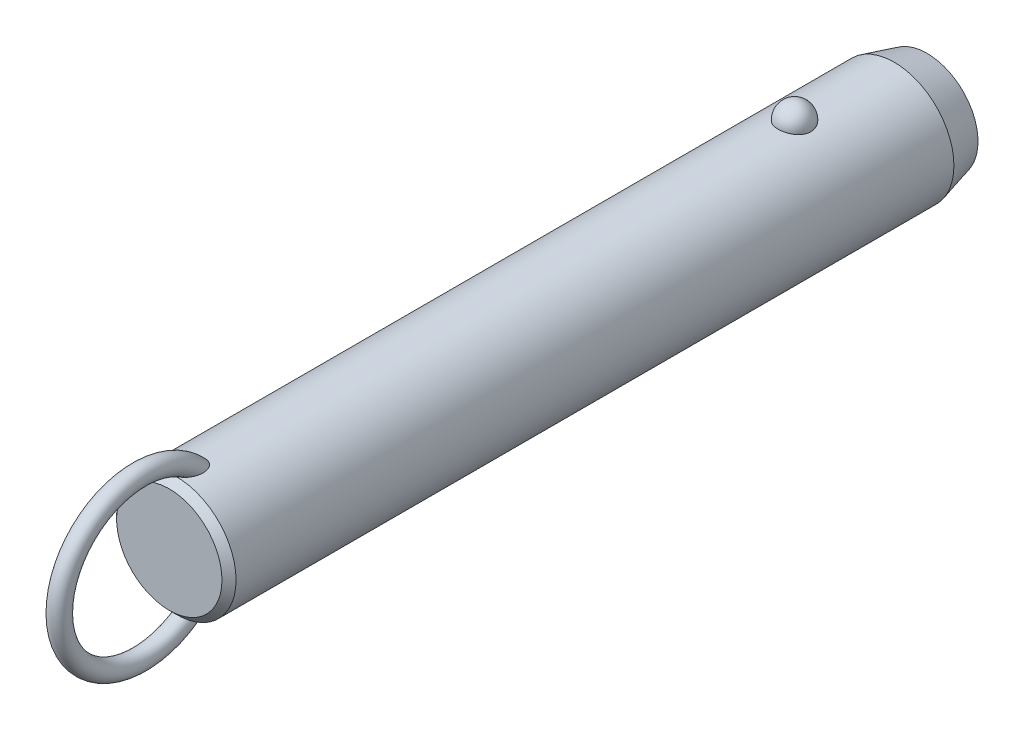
ISO-10303-21;
HEADER;
FILE_DESCRIPTION(('STEP AP214'),'2;1');
FILE_NAME('part.step','',(''),(''),'','','');
FILE_SCHEMA(('AUTOMOTIVE_DESIGN { 1 0 10303 214 1 1 1 1 }'));
ENDSEC;
DATA;
#1=APPLICATION_CONTEXT('core data for automotive mechanical design processes');
#2=APPLICATION_PROTOCOL_DEFINITION('international standard','automotive_design',2000,#1);
#3=PRODUCT_CONTEXT('',#1,'mechanical');
#4=PRODUCT('Part','Part','',(#3));
#5=PRODUCT_RELATED_PRODUCT_CATEGORY('part','',(#4));
#6=PRODUCT_DEFINITION_FORMATION('','',#4);
#7=PRODUCT_DEFINITION_CONTEXT('part definition',#1,'design');
#8=PRODUCT_DEFINITION('design','',#6,#7);
#9=PRODUCT_DEFINITION_SHAPE('','',#8);
#10=(LENGTH_UNIT() NAMED_UNIT(*) SI_UNIT(.MILLI.,.METRE.));
#11=(NAMED_UNIT(*) PLANE_ANGLE_UNIT() SI_UNIT($,.RADIAN.));
#12=(NAMED_UNIT(*) SI_UNIT($,.STERADIAN.) SOLID_ANGLE_UNIT());
#13=UNCERTAINTY_MEASURE_WITH_UNIT(LENGTH_MEASURE(1.E-05),#10,'distance_accuracy_value','');
#14=(GEOMETRIC_REPRESENTATION_CONTEXT(3) GLOBAL_UNCERTAINTY_ASSIGNED_CONTEXT((#13)) GLOBAL_UNIT_ASSIGNED_CONTEXT((#10,
#11,#12)) REPRESENTATION_CONTEXT('',''));
#15=CARTESIAN_POINT('',(0.,0.,0.));
#16=DIRECTION('',(0.,0.,1.));
#17=DIRECTION('',(1.,0.,0.));
#18=AXIS2_PLACEMENT_3D('',#15,#16,#17);
#19=CARTESIAN_POINT('',(0.,0.,116.8));
#20=DIRECTION('',(0.,0.,-1.));
#21=DIRECTION('',(-1.,0.,0.));
#22=AXIS2_PLACEMENT_3D('',#19,#20,#21);
#23=CYLINDRICAL_SURFACE('',#22,12.7);
#24=CARTESIAN_POINT('',(3.46661256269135,12.2177165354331,-3.5));
#25=CARTESIAN_POINT('',(3.4666090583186,12.2177194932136,-3.30432790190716));
#26=CARTESIAN_POINT('',(3.45063567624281,12.2222841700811,-3.10861112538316));
#27=CARTESIAN_POINT('',(3.38712451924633,12.2400345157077,-2.72271899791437));
#28=CARTESIAN_POINT('',(3.33957415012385,12.2532236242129,-2.53254588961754));
#29=CARTESIAN_POINT('',(3.2141234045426,12.286724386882,-2.16324948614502));
#30=CARTESIAN_POINT('',(3.13623639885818,12.3070329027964,-1.98412136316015));
#31=CARTESIAN_POINT('',(2.95205930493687,12.3525018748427,-1.64180592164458));
#32=CARTESIAN_POINT('',(2.84577003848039,12.3776621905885,-1.47861814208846));
#33=CARTESIAN_POINT('',(2.60688050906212,12.4301712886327,-1.17190583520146));
#34=CARTESIAN_POINT('',(2.47415697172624,12.4575299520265,-1.02847897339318));
#35=CARTESIAN_POINT('',(2.18615174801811,12.5112810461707,-0.766177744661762));
#36=CARTESIAN_POINT('',(2.03087002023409,12.5376734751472,-0.64730342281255));
#37=CARTESIAN_POINT('',(1.70237334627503,12.5864761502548,-0.437732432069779));
#38=CARTESIAN_POINT('',(1.52920948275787,12.6088972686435,-0.346958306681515));
#39=CARTESIAN_POINT('',(1.16944170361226,12.6473352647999,-0.195750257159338));
#40=CARTESIAN_POINT('',(0.982839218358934,12.663352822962,-0.135313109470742));
#41=CARTESIAN_POINT('',(0.604961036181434,12.6869706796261,-0.0473241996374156));
#42=CARTESIAN_POINT('',(0.41382314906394,12.6947125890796,-0.0192185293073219));
#43=CARTESIAN_POINT('',(0.0293827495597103,12.7014203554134,0.0051725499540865));
#44=CARTESIAN_POINT('',(-0.163919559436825,12.7003870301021,0.00146092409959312));
#45=CARTESIAN_POINT('',(-0.544374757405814,12.689735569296,-0.0373939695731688));
#46=CARTESIAN_POINT('',(-0.731575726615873,12.6802364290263,-0.0721015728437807));
#47=CARTESIAN_POINT('',(-1.09733277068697,12.6538333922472,-0.171364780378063));
#48=CARTESIAN_POINT('',(-1.27588869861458,12.6369293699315,-0.235920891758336));
#49=CARTESIAN_POINT('',(-1.6204698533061,12.5973946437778,-0.393548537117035));
#50=CARTESIAN_POINT('',(-1.78641865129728,12.5747321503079,-0.486778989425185));
#51=CARTESIAN_POINT('',(-2.10030671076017,12.5261316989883,-0.699110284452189));
#52=CARTESIAN_POINT('',(-2.24824419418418,12.5001934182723,-0.818213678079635));
#53=CARTESIAN_POINT('',(-2.52491489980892,12.4472906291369,-1.08157124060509));
#54=CARTESIAN_POINT('',(-2.65324222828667,12.4203160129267,-1.22624992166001));
#55=CARTESIAN_POINT('',(-2.88410007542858,12.3687509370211,-1.53528325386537));
#56=CARTESIAN_POINT('',(-2.98662883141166,12.3441606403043,-1.69963924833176));
#57=CARTESIAN_POINT('',(-3.16432417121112,12.2998199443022,-2.04548497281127));
#58=CARTESIAN_POINT('',(-3.23917525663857,12.2801261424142,-2.22714424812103));
#59=CARTESIAN_POINT('',(-3.35800573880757,12.248167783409,-2.6009138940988));
#60=CARTESIAN_POINT('',(-3.4019860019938,12.2359030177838,-2.79302397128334));
#61=CARTESIAN_POINT('',(-3.45784812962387,12.2202347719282,-3.18140279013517));
#62=CARTESIAN_POINT('',(-3.46986123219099,12.2167950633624,-3.37765118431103));
#63=CARTESIAN_POINT('',(-3.46186273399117,12.2190638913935,-3.76943689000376));
#64=CARTESIAN_POINT('',(-3.44185196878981,12.2247721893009,-3.96497421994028));
#65=CARTESIAN_POINT('',(-3.37048652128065,12.2446381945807,-4.34881728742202));
#66=CARTESIAN_POINT('',(-3.31928253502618,12.2587552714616,-4.53715319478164));
#67=CARTESIAN_POINT('',(-3.18693461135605,12.2938237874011,-4.90231727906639));
#68=CARTESIAN_POINT('',(-3.1057895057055,12.3147754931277,-5.07914500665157));
#69=CARTESIAN_POINT('',(-2.91506431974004,12.3613125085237,-5.41732059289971));
#70=CARTESIAN_POINT('',(-2.80533587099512,12.3869217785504,-5.57858147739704));
#71=CARTESIAN_POINT('',(-2.560414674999,12.4398525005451,-5.88013283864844));
#72=CARTESIAN_POINT('',(-2.42522099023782,12.4671740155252,-6.02042254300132));
#73=CARTESIAN_POINT('',(-2.1323357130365,12.5205965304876,-6.27662798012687));
#74=CARTESIAN_POINT('',(-1.97456596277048,12.5466928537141,-6.3924554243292));
#75=CARTESIAN_POINT('',(-1.64115839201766,12.5946384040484,-6.59583547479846));
#76=CARTESIAN_POINT('',(-1.46552179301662,12.6164879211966,-6.68339001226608));
#77=CARTESIAN_POINT('',(-1.10356050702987,12.6532533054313,-6.82682153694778));
#78=CARTESIAN_POINT('',(-0.9173913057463,12.6682500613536,-6.8830698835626));
#79=CARTESIAN_POINT('',(-0.537836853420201,12.6900288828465,-6.96386887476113));
#80=CARTESIAN_POINT('',(-0.344452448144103,12.6968119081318,-6.9884232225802));
#81=CARTESIAN_POINT('',(0.0402577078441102,12.7013667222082,-7.00496469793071));
#82=CARTESIAN_POINT('',(0.231556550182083,12.6993008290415,-6.99753844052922));
#83=CARTESIAN_POINT('',(0.610105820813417,12.6867505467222,-6.9516636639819));
#84=CARTESIAN_POINT('',(0.797356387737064,12.6762664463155,-6.913216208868));
#85=CARTESIAN_POINT('',(1.16186657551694,12.6480587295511,-6.80658431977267));
#86=CARTESIAN_POINT('',(1.33915951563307,12.6303611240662,-6.73850666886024));
#87=CARTESIAN_POINT('',(1.67968518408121,12.5896027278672,-6.5745087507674));
#88=CARTESIAN_POINT('',(1.84291705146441,12.5665416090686,-6.47858678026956));
#89=CARTESIAN_POINT('',(2.15340192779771,12.5171072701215,-6.25982455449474));
#90=CARTESIAN_POINT('',(2.30037831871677,12.4906895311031,-6.13660186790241));
#91=CARTESIAN_POINT('',(2.5717412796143,12.4376567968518,-5.86739587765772));
#92=CARTESIAN_POINT('',(2.69612388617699,12.4110417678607,-5.72140858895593));
#93=CARTESIAN_POINT('',(2.92107785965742,12.360051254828,-5.40794137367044));
#94=CARTESIAN_POINT('',(3.02121329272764,12.3357209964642,-5.24014110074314));
#95=CARTESIAN_POINT('',(3.19236291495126,12.2925446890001,-4.88969865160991));
#96=CARTESIAN_POINT('',(3.26338839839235,12.2736965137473,-4.70706226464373));
#97=CARTESIAN_POINT('',(3.36788038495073,12.245404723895,-4.35469510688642));
#98=CARTESIAN_POINT('',(3.40484026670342,12.2351018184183,-4.18605935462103));
#99=CARTESIAN_POINT('',(3.45420764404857,12.2212564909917,-3.84496058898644));
#100=CARTESIAN_POINT('',(3.46661565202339,12.2177139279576,-3.67249765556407));
#101=CARTESIAN_POINT('',(3.46661256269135,12.2177165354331,-3.5));
#102=B_SPLINE_CURVE_WITH_KNOTS('',3,(#24,#25,#26,#27,#28,#29,#30,#31,#32,#33,#34,#35,#36,#37,
#38,#39,#40,#41,#42,#43,#44,#45,#46,#47,#48,#49,#50,#51,#52,#53,#54,#55,#56,#57,#58,#59,#60,#61,
#62,#63,#64,#65,#66,#67,#68,#69,#70,#71,#72,#73,#74,#75,#76,#77,#78,#79,#80,#81,#82,#83,#84,#85,
#86,#87,#88,#89,#90,#91,#92,#93,#94,#95,#96,#97,#98,#99,#100,#101),.UNSPECIFIED.,.T.,.F.,(4,2,2,
2,2,2,2,2,2,2,2,2,2,2,2,2,2,2,2,2,2,2,2,2,2,2,2,2,2,2,2,2,2,2,2,2,2,2,4),(0.,0.586396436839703,
1.17302689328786,1.7593990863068,2.34575431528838,2.93491084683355,3.52406845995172,
4.11158733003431,4.69904375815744,5.2762784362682,5.85345931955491,6.42265312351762,
6.99185659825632,7.56427334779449,8.136746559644,8.71981013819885,9.3029135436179,
9.89247258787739,10.4820150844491,11.0691335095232,11.6562366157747,12.2405256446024,
12.8248374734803,13.412244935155,13.9996740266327,14.5891883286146,15.1786623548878,
15.7609861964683,16.3432419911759,16.9148635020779,17.4864654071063,18.0560241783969,
18.6256177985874,19.2037609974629,19.7820055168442,20.3699810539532,20.957728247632,
21.4746855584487,21.9916320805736),.UNSPECIFIED.);
#103=CARTESIAN_POINT('',(3.46661256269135,12.2177165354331,-3.5));
#104=VERTEX_POINT('',#103);
#105=EDGE_CURVE('E41',#104,#104,#102,.T.);
#106=ORIENTED_EDGE('',*,*,#105,.T.);
#107=EDGE_LOOP('',(#106));
#108=FACE_BOUND('',#107,.T.);
#109=CARTESIAN_POINT('',(0.,0.,128.));
#110=DIRECTION('',(0.,0.,1.));
#111=DIRECTION('',(1.,0.,0.));
#112=AXIS2_PLACEMENT_3D('',#109,#110,#111);
#113=CIRCLE('',#112,12.7);
#114=CARTESIAN_POINT('',(12.7,0.,128.));
#115=VERTEX_POINT('',#114);
#116=EDGE_CURVE('E10',#115,#115,#113,.F.);
#117=ORIENTED_EDGE('',*,*,#116,.T.);
#118=EDGE_LOOP('',(#117));
#119=FACE_BOUND('',#118,.T.);
#120=CARTESIAN_POINT('',(-0.548122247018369,-12.6881662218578,121.743218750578));
#121=CARTESIAN_POINT('',(-0.648865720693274,-12.6838128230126,121.777926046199));
#122=CARTESIAN_POINT('',(-0.746398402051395,-12.6783867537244,121.822042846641));
#123=CARTESIAN_POINT('',(-0.932125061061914,-12.666091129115,121.926764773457));
#124=CARTESIAN_POINT('',(-1.02030388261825,-12.6592192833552,121.987396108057));
#125=CARTESIAN_POINT('',(-1.18487740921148,-12.6448747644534,122.121847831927));
#126=CARTESIAN_POINT('',(-1.26134296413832,-12.637406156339,122.195582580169));
#127=CARTESIAN_POINT('',(-1.40231200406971,-12.6225412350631,122.353604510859));
#128=CARTESIAN_POINT('',(-1.46681470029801,-12.6151449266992,122.43789238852));
#129=CARTESIAN_POINT('',(-1.60714786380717,-12.5981718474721,122.649657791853));
#130=CARTESIAN_POINT('',(-1.67725126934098,-12.588900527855,122.780962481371));
#131=CARTESIAN_POINT('',(-1.79536591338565,-12.5725964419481,123.053247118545));
#132=CARTESIAN_POINT('',(-1.84333535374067,-12.5655679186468,123.194244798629));
#133=CARTESIAN_POINT('',(-1.93422576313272,-12.5519624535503,123.537645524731));
#134=CARTESIAN_POINT('',(-1.96788773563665,-12.5466298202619,123.742557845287));
#135=CARTESIAN_POINT('',(-1.9941399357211,-12.542463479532,124.051760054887));
#136=CARTESIAN_POINT('',(-1.99883864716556,-12.5417153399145,124.155298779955));
#137=CARTESIAN_POINT('',(-2.00078003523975,-12.5414074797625,124.36245124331));
#138=CARTESIAN_POINT('',(-1.99802449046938,-12.5418474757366,124.466064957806));
#139=CARTESIAN_POINT('',(-1.98336733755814,-12.5441750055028,124.710320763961));
#140=CARTESIAN_POINT('',(-1.96851430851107,-12.5465291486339,124.850780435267));
#141=CARTESIAN_POINT('',(-1.92707089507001,-12.5529612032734,125.129960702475));
#142=CARTESIAN_POINT('',(-1.90047458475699,-12.5570399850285,125.268680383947));
#143=CARTESIAN_POINT('',(-1.83619120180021,-12.5666008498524,125.54341135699));
#144=CARTESIAN_POINT('',(-1.79850828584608,-12.57208240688,125.679423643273));
#145=CARTESIAN_POINT('',(-1.71223796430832,-12.5841228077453,125.947842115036));
#146=CARTESIAN_POINT('',(-1.66365679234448,-12.5906810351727,126.080250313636));
#147=CARTESIAN_POINT('',(-1.5780450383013,-12.6016176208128,126.28548877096));
#148=CARTESIAN_POINT('',(-1.54477252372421,-12.6057501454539,126.359914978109));
#149=CARTESIAN_POINT('',(-1.47424480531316,-12.6141930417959,126.506839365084));
#150=CARTESIAN_POINT('',(-1.436990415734,-12.6185033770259,126.579337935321));
#151=CARTESIAN_POINT('',(-1.35825795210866,-12.6272207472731,126.721892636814));
#152=CARTESIAN_POINT('',(-1.31678520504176,-12.6316276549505,126.791951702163));
#153=CARTESIAN_POINT('',(-1.22917793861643,-12.6404532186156,126.929070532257));
#154=CARTESIAN_POINT('',(-1.18304514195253,-12.6448718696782,126.996131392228));
#155=CARTESIAN_POINT('',(-1.0724641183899,-12.6547893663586,127.143874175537));
#156=CARTESIAN_POINT('',(-1.00642239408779,-12.6602600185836,127.223384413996));
#157=CARTESIAN_POINT('',(-0.864441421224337,-12.6707460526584,127.373169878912));
#158=CARTESIAN_POINT('',(-0.788516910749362,-12.6757620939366,127.443458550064));
#159=CARTESIAN_POINT('',(-0.652215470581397,-12.6833591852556,127.548680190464));
#160=CARTESIAN_POINT('',(-0.594982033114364,-12.6861973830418,127.587624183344));
#161=CARTESIAN_POINT('',(-0.475269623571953,-12.6912445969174,127.656489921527));
#162=CARTESIAN_POINT('',(-0.412800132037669,-12.6934547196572,127.686427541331));
#163=CARTESIAN_POINT('',(-0.295749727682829,-12.6966636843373,127.729756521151));
#164=CARTESIAN_POINT('',(-0.241949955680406,-12.6978134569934,127.745218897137));
#165=CARTESIAN_POINT('',(-0.13250810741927,-12.6994261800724,127.766884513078));
#166=CARTESIAN_POINT('',(-0.0768679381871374,-12.6998898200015,127.773097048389));
#167=CARTESIAN_POINT('',(0.0347696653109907,-12.7000752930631,127.775583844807));
#168=CARTESIAN_POINT('',(0.0907676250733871,-12.6997954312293,127.771835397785));
#169=CARTESIAN_POINT('',(0.201283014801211,-12.6985255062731,127.754788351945));
#170=CARTESIAN_POINT('',(0.255799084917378,-12.6975348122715,127.741481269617));
#171=CARTESIAN_POINT('',(0.376042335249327,-12.6946091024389,127.70203792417));
#172=CARTESIAN_POINT('',(0.440950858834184,-12.6924943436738,127.673449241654));
#173=CARTESIAN_POINT('',(0.56535027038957,-12.6875639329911,127.606323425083));
#174=CARTESIAN_POINT('',(0.624828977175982,-12.6847467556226,127.567764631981));
#175=CARTESIAN_POINT('',(0.774116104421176,-12.6767252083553,127.456949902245));
#176=CARTESIAN_POINT('',(0.859449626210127,-12.6711344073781,127.378760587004));
#177=CARTESIAN_POINT('',(1.01789440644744,-12.6593922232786,127.210943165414));
#178=CARTESIAN_POINT('',(1.09096902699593,-12.653239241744,127.121282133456));
#179=CARTESIAN_POINT('',(1.22268793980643,-12.6411674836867,126.940265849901));
#180=CARTESIAN_POINT('',(1.28193986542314,-12.6352572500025,126.849345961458));
#181=CARTESIAN_POINT('',(1.39259777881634,-12.6235401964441,126.662792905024));
#182=CARTESIAN_POINT('',(1.44399707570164,-12.6177334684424,126.567155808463));
#183=CARTESIAN_POINT('',(1.53972870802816,-12.6064093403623,126.372273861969));
#184=CARTESIAN_POINT('',(1.58405262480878,-12.6008922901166,126.273024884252));
#185=CARTESIAN_POINT('',(1.66600705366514,-12.5903187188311,126.071772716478));
#186=CARTESIAN_POINT('',(1.70363651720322,-12.5852622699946,125.969769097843));
#187=CARTESIAN_POINT('',(1.77545379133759,-12.5753406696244,125.754358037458));
#188=CARTESIAN_POINT('',(1.80903453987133,-12.5705328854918,125.640745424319));
#189=CARTESIAN_POINT('',(1.86844163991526,-12.5618400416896,125.411457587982));
#190=CARTESIAN_POINT('',(1.89426665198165,-12.5579551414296,125.295782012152));
#191=CARTESIAN_POINT('',(1.93785464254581,-12.5513030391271,125.063007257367));
#192=CARTESIAN_POINT('',(1.95562640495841,-12.5485346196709,124.945909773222));
#193=CARTESIAN_POINT('',(1.98264463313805,-12.5442934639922,124.710747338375));
#194=CARTESIAN_POINT('',(1.99189298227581,-12.5428204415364,124.59268260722));
#195=CARTESIAN_POINT('',(2.00416068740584,-12.540871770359,124.280622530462));
#196=CARTESIAN_POINT('',(1.99944433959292,-12.541631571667,124.086229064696));
#197=CARTESIAN_POINT('',(1.96113755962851,-12.5476846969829,123.700309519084));
#198=CARTESIAN_POINT('',(1.92758341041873,-12.5529723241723,123.508780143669));
#199=CARTESIAN_POINT('',(1.83934342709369,-12.5661532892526,123.182272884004));
#200=CARTESIAN_POINT('',(1.79215440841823,-12.5730485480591,123.04524997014));
#201=CARTESIAN_POINT('',(1.67676242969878,-12.588958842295,122.780445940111));
#202=CARTESIAN_POINT('',(1.60859050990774,-12.597970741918,122.652651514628));
#203=CARTESIAN_POINT('',(1.46583832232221,-12.6152829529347,122.435800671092));
#204=CARTESIAN_POINT('',(1.39525727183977,-12.6233659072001,122.344105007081));
#205=CARTESIAN_POINT('',(1.23992594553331,-12.6395676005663,122.173485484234));
#206=CARTESIAN_POINT('',(1.15517932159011,-12.6476863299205,122.094558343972));
#207=CARTESIAN_POINT('',(0.971995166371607,-12.6630846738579,121.952643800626));
#208=CARTESIAN_POINT('',(0.873456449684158,-12.6703572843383,121.889784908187));
#209=CARTESIAN_POINT('',(0.665847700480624,-12.6829569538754,121.784487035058));
#210=CARTESIAN_POINT('',(0.5567845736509,-12.688285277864,121.742034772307));
#211=CARTESIAN_POINT('',(0.347338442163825,-12.6956226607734,121.684443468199));
#212=CARTESIAN_POINT('',(0.247759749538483,-12.6979816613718,121.666399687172));
#213=CARTESIAN_POINT('',(0.0470218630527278,-12.7003077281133,121.648600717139));
#214=CARTESIAN_POINT('',(-0.0541350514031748,-12.7002779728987,121.648821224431));
#215=CARTESIAN_POINT('',(-0.221414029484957,-12.6982482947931,121.664363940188));
#216=CARTESIAN_POINT('',(-0.288055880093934,-12.6969033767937,121.674666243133));
#217=CARTESIAN_POINT('',(-0.419599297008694,-12.6932369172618,121.70313489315));
#218=CARTESIAN_POINT('',(-0.484501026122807,-12.6909154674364,121.721300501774));
#219=CARTESIAN_POINT('',(-0.548122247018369,-12.6881662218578,121.743218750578));
#220=B_SPLINE_CURVE_WITH_KNOTS('',3,(#120,#121,#122,#123,#124,#125,#126,#127,#128,#129,#130,
#131,#132,#133,#134,#135,#136,#137,#138,#139,#140,#141,#142,#143,#144,#145,#146,#147,#148,#149,
#150,#151,#152,#153,#154,#155,#156,#157,#158,#159,#160,#161,#162,#163,#164,#165,#166,#167,#168,
#169,#170,#171,#172,#173,#174,#175,#176,#177,#178,#179,#180,#181,#182,#183,#184,#185,#186,#187,
#188,#189,#190,#191,#192,#193,#194,#195,#196,#197,#198,#199,#200,#201,#202,#203,#204,#205,#206,
#207,#208,#209,#210,#211,#212,#213,#214,#215,#216,#217,#218,#219),.UNSPECIFIED.,.T.,.F.,(4,2,2,
2,2,2,2,2,2,2,2,2,2,2,2,2,2,2,2,2,2,2,2,2,2,2,2,2,2,2,2,2,2,2,2,2,2,2,2,2,2,2,2,2,2,2,2,2,2,4),
(0.,0.319642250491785,0.639794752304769,0.957927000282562,1.27608021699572,1.72100165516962,
2.16675988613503,2.78630021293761,3.0970578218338,3.40774128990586,3.83096358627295,
4.2543996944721,4.67767724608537,5.10071330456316,5.34550297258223,5.59024267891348,
5.83467707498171,6.07902143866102,6.38891080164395,6.69834321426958,6.90560910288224,
7.11250749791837,7.27977315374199,7.44687060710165,7.61434932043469,7.78197685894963,
7.99365544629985,8.20579780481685,8.55147335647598,8.89816429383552,9.22375138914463,
9.54961437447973,9.87586224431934,10.202161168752,10.5575872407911,10.9130746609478,
11.2681734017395,11.6231936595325,12.2046601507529,12.7853961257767,13.219164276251,
13.6522938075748,13.9989174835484,14.3454519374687,14.6946768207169,15.0436740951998,
15.3457513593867,15.6474266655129,15.8493051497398,16.0511646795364),.UNSPECIFIED.);
#221=CARTESIAN_POINT('',(-0.548122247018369,-12.6881662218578,121.743218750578));
#222=VERTEX_POINT('',#221);
#223=EDGE_CURVE('E59',#222,#222,#220,.T.);
#224=ORIENTED_EDGE('',*,*,#223,.T.);
#225=EDGE_LOOP('',(#224));
#226=FACE_BOUND('',#225,.T.);
#227=CARTESIAN_POINT('',(-0.548122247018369,12.6881662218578,121.743218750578));
#228=CARTESIAN_POINT('',(-0.459436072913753,12.6919968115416,121.712673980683));
#229=CARTESIAN_POINT('',(-0.368189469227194,12.6949996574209,121.689391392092));
#230=CARTESIAN_POINT('',(-0.183024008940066,12.6990186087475,121.658406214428));
#231=CARTESIAN_POINT('',(-0.0891049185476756,12.7000345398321,121.650704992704));
#232=CARTESIAN_POINT('',(0.0987147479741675,12.6999636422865,121.651245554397));
#233=CARTESIAN_POINT('',(0.192615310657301,12.6988761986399,121.659492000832));
#234=CARTESIAN_POINT('',(0.377658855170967,12.6947211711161,121.691551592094));
#235=CARTESIAN_POINT('',(0.468801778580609,12.6916535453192,121.715365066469));
#236=CARTESIAN_POINT('',(0.645809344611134,12.6838788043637,121.77745651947));
#237=CARTESIAN_POINT('',(0.731679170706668,12.6791733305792,121.815720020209));
#238=CARTESIAN_POINT('',(0.896315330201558,12.6686004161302,121.905120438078));
#239=CARTESIAN_POINT('',(0.975080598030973,12.6627328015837,121.956259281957));
#240=CARTESIAN_POINT('',(1.12963655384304,12.6499161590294,122.07367820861));
#241=CARTESIAN_POINT('',(1.20478673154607,12.6429194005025,122.140792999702));
#242=CARTESIAN_POINT('',(1.34448241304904,12.6288282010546,122.28522507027));
#243=CARTESIAN_POINT('',(1.40902173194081,12.621733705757,122.362548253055));
#244=CARTESIAN_POINT('',(1.55208211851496,12.6050877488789,122.559247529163));
#245=CARTESIAN_POINT('',(1.62510490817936,12.5957546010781,122.682654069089));
#246=CARTESIAN_POINT('',(1.75019044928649,12.5789823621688,122.939769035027));
#247=CARTESIAN_POINT('',(1.80221377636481,12.5715468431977,123.073496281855));
#248=CARTESIAN_POINT('',(1.90309965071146,12.5567434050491,123.398351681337));
#249=CARTESIAN_POINT('',(1.94342317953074,12.5504515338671,123.592161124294));
#250=CARTESIAN_POINT('',(1.99332997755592,12.5426147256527,123.98378810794));
#251=CARTESIAN_POINT('',(2.00285305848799,12.5410790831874,124.181612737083));
#252=CARTESIAN_POINT('',(1.99678999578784,12.5420407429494,124.516642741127));
#253=CARTESIAN_POINT('',(1.98794117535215,12.5434564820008,124.654042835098));
#254=CARTESIAN_POINT('',(1.95865119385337,12.5480641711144,124.927639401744));
#255=CARTESIAN_POINT('',(1.93820436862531,12.5512569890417,125.063835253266));
#256=CARTESIAN_POINT('',(1.88647896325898,12.5591352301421,125.334249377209));
#257=CARTESIAN_POINT('',(1.85518800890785,12.5638223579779,125.46846520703));
#258=CARTESIAN_POINT('',(1.78217886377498,12.5743868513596,125.733936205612));
#259=CARTESIAN_POINT('',(1.74046509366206,12.5802637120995,125.865192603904));
#260=CARTESIAN_POINT('',(1.66024095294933,12.5910571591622,126.086085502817));
#261=CARTESIAN_POINT('',(1.62434772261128,12.5957535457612,126.176690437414));
#262=CARTESIAN_POINT('',(1.54709009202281,12.6054762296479,126.355512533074));
#263=CARTESIAN_POINT('',(1.50572681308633,12.6105024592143,126.443730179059));
#264=CARTESIAN_POINT('',(1.41728020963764,12.620748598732,126.616932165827));
#265=CARTESIAN_POINT('',(1.37021377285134,12.625967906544,126.701925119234));
#266=CARTESIAN_POINT('',(1.26969620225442,12.6364721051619,126.868007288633));
#267=CARTESIAN_POINT('',(1.21624929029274,12.6417569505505,126.949099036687));
#268=CARTESIAN_POINT('',(1.10304413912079,12.6521331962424,127.104702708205));
#269=CARTESIAN_POINT('',(1.04340936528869,12.657226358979,127.179303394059));
#270=CARTESIAN_POINT('',(0.915919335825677,12.6670906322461,127.321324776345));
#271=CARTESIAN_POINT('',(0.848064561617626,12.6718617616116,127.388745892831));
#272=CARTESIAN_POINT('',(0.717035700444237,12.67987711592,127.500624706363));
#273=CARTESIAN_POINT('',(0.655526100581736,12.6832377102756,127.546997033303));
#274=CARTESIAN_POINT('',(0.525985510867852,12.6892676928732,127.629619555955));
#275=CARTESIAN_POINT('',(0.457969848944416,12.6919386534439,127.665892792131));
#276=CARTESIAN_POINT('',(0.334859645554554,12.695691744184,127.716657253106));
#277=CARTESIAN_POINT('',(0.28111658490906,12.6970073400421,127.734373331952));
#278=CARTESIAN_POINT('',(0.171425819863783,12.6989609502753,127.760642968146));
#279=CARTESIAN_POINT('',(0.115480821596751,12.699599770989,127.769207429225));
#280=CARTESIAN_POINT('',(0.0027261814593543,12.7001251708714,127.776253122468));
#281=CARTESIAN_POINT('',(-0.054085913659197,12.7000089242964,127.774696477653));
#282=CARTESIAN_POINT('',(-0.166544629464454,12.6990328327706,127.761600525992));
#283=CARTESIAN_POINT('',(-0.222190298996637,12.6981724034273,127.750053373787));
#284=CARTESIAN_POINT('',(-0.342018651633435,12.695562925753,127.714912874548));
#285=CARTESIAN_POINT('',(-0.405606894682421,12.6936676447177,127.68933225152));
#286=CARTESIAN_POINT('',(-0.5278154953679,12.6891754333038,127.628311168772));
#287=CARTESIAN_POINT('',(-0.586425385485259,12.6865770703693,127.592850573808));
#288=CARTESIAN_POINT('',(-0.731842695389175,12.6792129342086,127.491496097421));
#289=CARTESIAN_POINT('',(-0.814709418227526,12.6740767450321,127.4200395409));
#290=CARTESIAN_POINT('',(-0.96910175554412,12.6632083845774,127.26589007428));
#291=CARTESIAN_POINT('',(-1.04059564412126,12.6574746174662,127.183166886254));
#292=CARTESIAN_POINT('',(-1.16981116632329,12.6461638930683,127.015809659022));
#293=CARTESIAN_POINT('',(-1.22811369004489,12.6405994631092,126.931616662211));
#294=CARTESIAN_POINT('',(-1.33743405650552,12.6295007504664,126.758579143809));
#295=CARTESIAN_POINT('',(-1.38844577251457,12.6239664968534,126.669730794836));
#296=CARTESIAN_POINT('',(-1.48400702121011,12.6130898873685,126.488389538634));
#297=CARTESIAN_POINT('',(-1.52854232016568,12.6077479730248,126.395889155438));
#298=CARTESIAN_POINT('',(-1.61150113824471,12.5974127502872,126.208160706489));
#299=CARTESIAN_POINT('',(-1.64992317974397,12.5924195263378,126.112931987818));
#300=CARTESIAN_POINT('',(-1.73468589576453,12.581070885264,125.88289362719));
#301=CARTESIAN_POINT('',(-1.77831261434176,12.5749388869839,125.747066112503));
#302=CARTESIAN_POINT('',(-1.85439734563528,12.5639437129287,125.472212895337));
#303=CARTESIAN_POINT('',(-1.88684994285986,12.5590811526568,125.333185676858));
#304=CARTESIAN_POINT('',(-1.94008483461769,12.550968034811,125.05309235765));
#305=CARTESIAN_POINT('',(-1.96088706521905,12.5477147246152,124.912030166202));
#306=CARTESIAN_POINT('',(-1.99000539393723,12.5431291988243,124.628668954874));
#307=CARTESIAN_POINT('',(-1.99832911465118,12.5417958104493,124.486370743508));
#308=CARTESIAN_POINT('',(-2.00166624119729,12.5412674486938,124.157627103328));
#309=CARTESIAN_POINT('',(-1.99178843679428,12.5428579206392,123.971088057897));
#310=CARTESIAN_POINT('',(-1.9445518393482,12.5502731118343,123.60162404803));
#311=CARTESIAN_POINT('',(-1.90724032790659,12.5560905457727,123.418693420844));
#312=CARTESIAN_POINT('',(-1.81330718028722,12.5699462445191,123.104848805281));
#313=CARTESIAN_POINT('',(-1.76338820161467,12.5771273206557,122.971910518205));
#314=CARTESIAN_POINT('',(-1.64305018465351,12.593414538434,122.715681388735));
#315=CARTESIAN_POINT('',(-1.57265346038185,12.6025185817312,122.592380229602));
#316=CARTESIAN_POINT('',(-1.42634956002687,12.6198178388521,122.383564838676));
#317=CARTESIAN_POINT('',(-1.35423772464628,12.6278405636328,122.295384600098));
#318=CARTESIAN_POINT('',(-1.19645664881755,12.6437632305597,122.132107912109));
#319=CARTESIAN_POINT('',(-1.11080536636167,12.6516633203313,122.056994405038));
#320=CARTESIAN_POINT('',(-0.947219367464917,12.6648319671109,121.937811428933));
#321=CARTESIAN_POINT('',(-0.871624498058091,12.670300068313,121.890541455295));
#322=CARTESIAN_POINT('',(-0.714161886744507,12.6801492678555,121.8077413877));
#323=CARTESIAN_POINT('',(-0.632295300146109,12.684530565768,121.77220913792));
#324=CARTESIAN_POINT('',(-0.548122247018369,12.6881662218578,121.743218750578));
#325=B_SPLINE_CURVE_WITH_KNOTS('',3,(#227,#228,#229,#230,#231,#232,#233,#234,#235,#236,#237,
#238,#239,#240,#241,#242,#243,#244,#245,#246,#247,#248,#249,#250,#251,#252,#253,#254,#255,#256,
#257,#258,#259,#260,#261,#262,#263,#264,#265,#266,#267,#268,#269,#270,#271,#272,#273,#274,#275,
#276,#277,#278,#279,#280,#281,#282,#283,#284,#285,#286,#287,#288,#289,#290,#291,#292,#293,#294,
#295,#296,#297,#298,#299,#300,#301,#302,#303,#304,#305,#306,#307,#308,#309,#310,#311,#312,#313,
#314,#315,#316,#317,#318,#319,#320,#321,#322,#323,#324),.UNSPECIFIED.,.T.,.F.,(4,2,2,2,2,2,2,2,
2,2,2,2,2,2,2,2,2,2,2,2,2,2,2,2,2,2,2,2,2,2,2,2,2,2,2,2,2,2,2,2,2,2,2,2,2,2,2,2,4),(0.,
0.281328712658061,0.562682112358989,0.844117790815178,1.12555942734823,1.40671982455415,
1.68792232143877,1.98972294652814,2.2916988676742,2.72039860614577,3.14989948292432,
3.7408491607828,4.33295293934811,4.7455410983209,5.158330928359,5.57159335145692,
5.98468079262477,6.27722775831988,6.56971484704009,6.86135609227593,7.15280542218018,
7.43927407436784,7.72572595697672,7.95635862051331,8.18646071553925,8.35559393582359,
8.52452541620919,8.69408946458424,8.86378678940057,9.06834348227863,9.27332014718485,
9.60010414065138,9.9277843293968,10.2350252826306,10.5425229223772,10.8506864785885,
11.1589244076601,11.5867893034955,12.0148612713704,12.4421984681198,12.8692745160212,
13.4279365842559,13.9856380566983,14.4107062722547,14.8353130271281,15.1765567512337,
15.5173516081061,15.7844129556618,16.051425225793),.UNSPECIFIED.);
#326=CARTESIAN_POINT('',(-0.548122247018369,12.6881662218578,121.743218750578));
#327=VERTEX_POINT('',#326);
#328=EDGE_CURVE('E66',#327,#327,#325,.T.);
#329=ORIENTED_EDGE('',*,*,#328,.T.);
#330=EDGE_LOOP('',(#329));
#331=FACE_BOUND('',#330,.T.);
#332=CARTESIAN_POINT('',(0.,0.,-24.7));
#333=DIRECTION('',(0.,0.,-1.));
#334=DIRECTION('',(-1.,0.,0.));
#335=AXIS2_PLACEMENT_3D('',#332,#333,#334);
#336=CIRCLE('',#335,12.7);
#337=CARTESIAN_POINT('',(12.7,0.,-24.7));
#338=VERTEX_POINT('',#337);
#339=EDGE_CURVE('E56',#338,#338,#336,.F.);
#340=ORIENTED_EDGE('',*,*,#339,.T.);
#341=EDGE_LOOP('',(#340));
#342=FACE_BOUND('',#341,.T.);
#343=ADVANCED_FACE('F37',(#108,#119,#226,#331,#342),#23,.T.);
#344=CARTESIAN_POINT('',(0.,0.,-31.7));
#345=DIRECTION('',(0.,0.,-1.));
#346=DIRECTION('',(-1.,0.,0.));
#347=AXIS2_PLACEMENT_3D('',#344,#345,#346);
#348=PLANE('',#347);
#349=CARTESIAN_POINT('',(0.,0.,-31.7));
#350=DIRECTION('',(0.,0.,-1.));
#351=DIRECTION('',(-1.,0.,0.));
#352=AXIS2_PLACEMENT_3D('',#349,#350,#351);
#353=CIRCLE('',#352,10.8243556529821);
#354=CARTESIAN_POINT('',(10.8243556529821,0.,-31.7));
#355=VERTEX_POINT('',#354);
#356=EDGE_CURVE('E65',#355,#355,#353,.T.);
#357=ORIENTED_EDGE('',*,*,#356,.T.);
#358=EDGE_LOOP('',(#357));
#359=FACE_BOUND('',#358,.T.);
#360=ADVANCED_FACE('F84',(#359),#348,.T.);
#361=CARTESIAN_POINT('',(0.,0.,-31.7));
#362=DIRECTION('',(0.,0.,1.));
#363=DIRECTION('',(1.,0.,0.));
#364=AXIS2_PLACEMENT_3D('',#361,#362,#363);
#365=CONICAL_SURFACE('',#364,10.8243556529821,0.261799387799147);
#366=CARTESIAN_POINT('',(12.7,0.,-24.7));
#367=CARTESIAN_POINT('',(12.6804620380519,0.,-24.7729166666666));
#368=CARTESIAN_POINT('',(12.6609240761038,0.,-24.8458333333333));
#369=CARTESIAN_POINT('',(12.6218481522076,0.,-24.9916666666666));
#370=CARTESIAN_POINT('',(12.6023101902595,0.,-25.0645833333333));
#371=CARTESIAN_POINT('',(12.5632342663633,0.,-25.2104166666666));
#372=CARTESIAN_POINT('',(12.5436963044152,0.,-25.2833333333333));
#373=CARTESIAN_POINT('',(12.504620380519,0.,-25.4291666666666));
#374=CARTESIAN_POINT('',(12.4850824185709,0.,-25.5020833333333));
#375=CARTESIAN_POINT('',(12.4460064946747,0.,-25.6479166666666));
#376=CARTESIAN_POINT('',(12.4264685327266,0.,-25.7208333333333));
#377=CARTESIAN_POINT('',(12.3873926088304,0.,-25.8666666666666));
#378=CARTESIAN_POINT('',(12.3678546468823,0.,-25.9395833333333));
#379=CARTESIAN_POINT('',(12.328778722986,0.,-26.0854166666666));
#380=CARTESIAN_POINT('',(12.3092407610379,0.,-26.1583333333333));
#381=CARTESIAN_POINT('',(12.2701648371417,0.,-26.3041666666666));
#382=CARTESIAN_POINT('',(12.2506268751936,0.,-26.3770833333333));
#383=CARTESIAN_POINT('',(12.2115509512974,0.,-26.5229166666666));
#384=CARTESIAN_POINT('',(12.1920129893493,0.,-26.5958333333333));
#385=CARTESIAN_POINT('',(12.1529370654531,0.,-26.7416666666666));
#386=CARTESIAN_POINT('',(12.133399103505,0.,-26.8145833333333));
#387=CARTESIAN_POINT('',(12.0943231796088,0.,-26.9604166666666));
#388=CARTESIAN_POINT('',(12.0747852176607,0.,-27.0333333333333));
#389=CARTESIAN_POINT('',(12.0357092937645,0.,-27.1791666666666));
#390=CARTESIAN_POINT('',(12.0161713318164,0.,-27.2520833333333));
#391=CARTESIAN_POINT('',(11.9770954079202,0.,-27.3979166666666));
#392=CARTESIAN_POINT('',(11.9575574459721,0.,-27.4708333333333));
#393=CARTESIAN_POINT('',(11.9184815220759,0.,-27.6166666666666));
#394=CARTESIAN_POINT('',(11.8989435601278,0.,-27.6895833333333));
#395=CARTESIAN_POINT('',(11.8598676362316,0.,-27.8354166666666));
#396=CARTESIAN_POINT('',(11.8403296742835,0.,-27.9083333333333));
#397=CARTESIAN_POINT('',(11.8012537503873,0.,-28.0541666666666));
#398=CARTESIAN_POINT('',(11.7817157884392,0.,-28.1270833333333));
#399=CARTESIAN_POINT('',(11.742639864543,0.,-28.2729166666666));
#400=CARTESIAN_POINT('',(11.7231019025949,0.,-28.3458333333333));
#401=CARTESIAN_POINT('',(11.6840259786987,0.,-28.4916666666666));
#402=CARTESIAN_POINT('',(11.6644880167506,0.,-28.5645833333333));
#403=CARTESIAN_POINT('',(11.6254120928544,0.,-28.7104166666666));
#404=CARTESIAN_POINT('',(11.6058741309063,0.,-28.7833333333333));
#405=CARTESIAN_POINT('',(11.56679820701,0.,-28.9291666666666));
#406=CARTESIAN_POINT('',(11.5472602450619,0.,-29.0020833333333));
#407=CARTESIAN_POINT('',(11.5081843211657,0.,-29.1479166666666));
#408=CARTESIAN_POINT('',(11.4886463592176,0.,-29.2208333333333));
#409=CARTESIAN_POINT('',(11.4495704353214,0.,-29.3666666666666));
#410=CARTESIAN_POINT('',(11.4300324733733,0.,-29.4395833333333));
#411=CARTESIAN_POINT('',(11.3909565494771,0.,-29.5854166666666));
#412=CARTESIAN_POINT('',(11.371418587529,0.,-29.6583333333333));
#413=CARTESIAN_POINT('',(11.3323426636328,0.,-29.8041666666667));
#414=CARTESIAN_POINT('',(11.3128047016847,0.,-29.8770833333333));
#415=CARTESIAN_POINT('',(11.2737287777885,0.,-30.0229166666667));
#416=CARTESIAN_POINT('',(11.2541908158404,0.,-30.0958333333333));
#417=CARTESIAN_POINT('',(11.2151148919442,0.,-30.2416666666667));
#418=CARTESIAN_POINT('',(11.1955769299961,0.,-30.3145833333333));
#419=CARTESIAN_POINT('',(11.1565010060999,0.,-30.4604166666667));
#420=CARTESIAN_POINT('',(11.1369630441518,0.,-30.5333333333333));
#421=CARTESIAN_POINT('',(11.0978871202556,0.,-30.6791666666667));
#422=CARTESIAN_POINT('',(11.0783491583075,0.,-30.7520833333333));
#423=CARTESIAN_POINT('',(11.0392732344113,0.,-30.8979166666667));
#424=CARTESIAN_POINT('',(11.0197352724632,0.,-30.9708333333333));
#425=CARTESIAN_POINT('',(10.980659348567,0.,-31.1166666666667));
#426=CARTESIAN_POINT('',(10.9611213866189,0.,-31.1895833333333));
#427=CARTESIAN_POINT('',(10.9220454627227,0.,-31.3354166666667));
#428=CARTESIAN_POINT('',(10.9025075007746,0.,-31.4083333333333));
#429=CARTESIAN_POINT('',(10.8634315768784,0.,-31.5541666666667));
#430=CARTESIAN_POINT('',(10.8438936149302,0.,-31.6270833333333));
#431=CARTESIAN_POINT('',(10.8243556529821,0.,-31.7));
#432=B_SPLINE_CURVE_WITH_KNOTS('',3,(#366,#367,#368,#369,#370,#371,#372,#373,#374,#375,#376,
#377,#378,#379,#380,#381,#382,#383,#384,#385,#386,#387,#388,#389,#390,#391,#392,#393,#394,#395,
#396,#397,#398,#399,#400,#401,#402,#403,#404,#405,#406,#407,#408,#409,#410,#411,#412,#413,#414,
#415,#416,#417,#418,#419,#420,#421,#422,#423,#424,#425,#426,#427,#428,#429,#430,#431),
.UNSPECIFIED.,.F.,.F.,(4,2,2,2,2,2,2,2,2,2,2,2,2,2,2,2,2,2,2,2,2,2,2,2,2,2,2,2,2,2,2,2,4),(0.,
0.226466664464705,0.452933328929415,0.679399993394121,0.905866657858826,1.13233332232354,
1.35879998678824,1.58526665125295,1.81173331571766,2.03819998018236,2.26466664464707,
2.49113330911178,2.71759997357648,2.94406663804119,3.1705333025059,3.3969999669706,
3.62346663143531,3.84993329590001,4.07639996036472,4.30286662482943,4.52933328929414,
4.75579995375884,4.98226661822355,5.20873328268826,5.43519994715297,5.66166661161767,
5.88813327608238,6.11459994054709,6.34106660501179,6.5675332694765,6.7939999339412,
7.02046659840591,7.24693326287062),.UNSPECIFIED.);
#433=EDGE_CURVE('BSEAM82',#338,#355,#432,.T.);
#434=ORIENTED_EDGE('',*,*,#339,.F.);
#435=ORIENTED_EDGE('',*,*,#356,.F.);
#436=ORIENTED_EDGE('',*,*,#433,.T.);
#437=ORIENTED_EDGE('',*,*,#433,.F.);
#438=EDGE_LOOP('',(#434,#436,#435,#437));
#439=FACE_BOUND('',#438,.T.);
#440=ADVANCED_FACE('F82',(#439),#365,.T.);
#441=CARTESIAN_POINT('',(0.,0.,129.5));
#442=DIRECTION('',(0.,0.,1.));
#443=DIRECTION('',(1.,0.,0.));
#444=AXIS2_PLACEMENT_3D('',#441,#442,#443);
#445=PLANE('',#444);
#446=CARTESIAN_POINT('',(0.,0.,129.5));
#447=DIRECTION('',(0.,0.,1.));
#448=DIRECTION('',(1.,0.,0.));
#449=AXIS2_PLACEMENT_3D('',#446,#447,#448);
#450=CIRCLE('',#449,11.2);
#451=CARTESIAN_POINT('',(11.2,0.,129.5));
#452=VERTEX_POINT('',#451);
#453=EDGE_CURVE('E50',#452,#452,#450,.T.);
#454=ORIENTED_EDGE('',*,*,#453,.T.);
#455=EDGE_LOOP('',(#454));
#456=FACE_BOUND('',#455,.T.);
#457=ADVANCED_FACE('F76',(#456),#445,.T.);
#458=CARTESIAN_POINT('',(0.,0.,135.85));
#459=DIRECTION('',(1.,0.,0.));
#460=DIRECTION('',(0.,0.,-1.));
#461=AXIS2_PLACEMENT_3D('',#458,#459,#460);
#462=TOROIDAL_SURFACE('',#461,17.05,2.);
#463=ORIENTED_EDGE('',*,*,#328,.F.);
#464=EDGE_LOOP('',(#463));
#465=FACE_BOUND('',#464,.T.);
#466=ORIENTED_EDGE('',*,*,#223,.F.);
#467=EDGE_LOOP('',(#466));
#468=FACE_BOUND('',#467,.T.);
#469=ADVANCED_FACE('F72',(#465,#468),#462,.T.);
#470=CARTESIAN_POINT('',(0.,0.,129.5));
#471=DIRECTION('',(0.,0.,-1.));
#472=DIRECTION('',(-1.,0.,0.));
#473=AXIS2_PLACEMENT_3D('',#470,#471,#472);
#474=CONICAL_SURFACE('',#473,11.2,0.785398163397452);
#475=ORIENTED_EDGE('',*,*,#116,.F.);
#476=EDGE_LOOP('',(#475));
#477=FACE_BOUND('',#476,.T.);
#478=ORIENTED_EDGE('',*,*,#453,.F.);
#479=EDGE_LOOP('',(#478));
#480=FACE_BOUND('',#479,.T.);
#481=ADVANCED_FACE('F39',(#477,#480),#474,.T.);
#482=CARTESIAN_POINT('',(0.,12.7,-3.5));
#483=DIRECTION('',(0.,1.,0.));
#484=DIRECTION('',(0.,0.,-1.));
#485=AXIS2_PLACEMENT_3D('',#482,#483,#484);
#486=SPHERICAL_SURFACE('',#485,3.5);
#487=ORIENTED_EDGE('',*,*,#105,.F.);
#488=EDGE_LOOP('',(#487));
#489=FACE_BOUND('',#488,.T.);
#490=ADVANCED_FACE('F78',(#489),#486,.T.);
#491=CLOSED_SHELL('',(#343,#360,#440,#457,#469,#481,#490));
#492=MANIFOLD_SOLID_BREP('B2',#491);
#493=ADVANCED_BREP_SHAPE_REPRESENTATION('',(#18,#492),#14);
#494=SHAPE_DEFINITION_REPRESENTATION(#9,#493);
ENDSEC;
END-ISO-10303-21;
